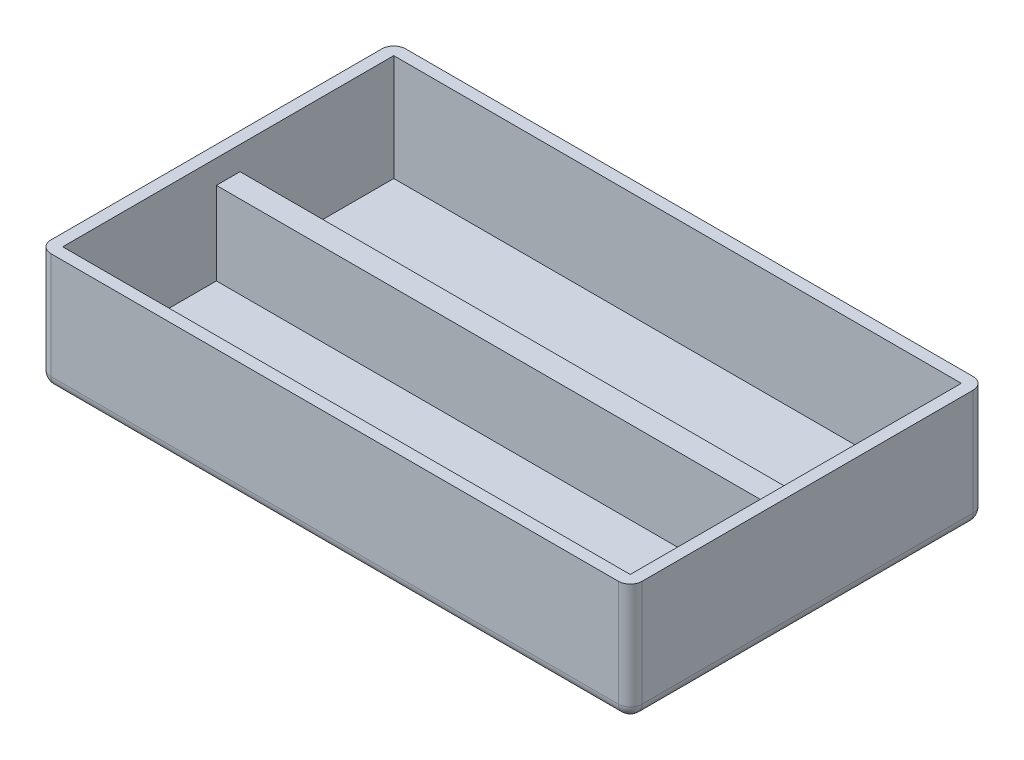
ISO-10303-21;
HEADER;
FILE_DESCRIPTION(('STEP AP214'),'2;1');
FILE_NAME('part.step','',(''),(''),'','','');
FILE_SCHEMA(('AUTOMOTIVE_DESIGN { 1 0 10303 214 1 1 1 1 }'));
ENDSEC;
DATA;
#1=APPLICATION_CONTEXT('core data for automotive mechanical design processes');
#2=APPLICATION_PROTOCOL_DEFINITION('international standard','automotive_design',2000,#1);
#3=PRODUCT_CONTEXT('',#1,'mechanical');
#4=PRODUCT('Part','Part','',(#3));
#5=PRODUCT_RELATED_PRODUCT_CATEGORY('part','',(#4));
#6=PRODUCT_DEFINITION_FORMATION('','',#4);
#7=PRODUCT_DEFINITION_CONTEXT('part definition',#1,'design');
#8=PRODUCT_DEFINITION('design','',#6,#7);
#9=PRODUCT_DEFINITION_SHAPE('','',#8);
#10=(LENGTH_UNIT() NAMED_UNIT(*) SI_UNIT(.MILLI.,.METRE.));
#11=(NAMED_UNIT(*) PLANE_ANGLE_UNIT() SI_UNIT($,.RADIAN.));
#12=(NAMED_UNIT(*) SI_UNIT($,.STERADIAN.) SOLID_ANGLE_UNIT());
#13=UNCERTAINTY_MEASURE_WITH_UNIT(LENGTH_MEASURE(1.E-05),#10,'distance_accuracy_value','');
#14=(GEOMETRIC_REPRESENTATION_CONTEXT(3) GLOBAL_UNCERTAINTY_ASSIGNED_CONTEXT((#13)) GLOBAL_UNIT_ASSIGNED_CONTEXT((#10,
#11,#12)) REPRESENTATION_CONTEXT('',''));
#15=CARTESIAN_POINT('',(0.,0.,0.));
#16=DIRECTION('',(0.,0.,1.));
#17=DIRECTION('',(1.,0.,0.));
#18=AXIS2_PLACEMENT_3D('',#15,#16,#17);
#19=CARTESIAN_POINT('',(60.96,25.4,-38.1));
#20=DIRECTION('',(-1.,0.,0.));
#21=DIRECTION('',(0.,0.,1.));
#22=AXIS2_PLACEMENT_3D('',#19,#20,#21);
#23=PLANE('',#22);
#24=DIRECTION('',(0.,0.,-1.));
#25=VECTOR('',#24,1.);
#26=CARTESIAN_POINT('',(60.96,20.32,-38.1));
#27=LINE('',#26,#25);
#28=CARTESIAN_POINT('',(60.96,20.32,2.54));
#29=VERTEX_POINT('',#28);
#30=CARTESIAN_POINT('',(60.96,20.32,-2.54));
#31=VERTEX_POINT('',#30);
#32=EDGE_CURVE('E11',#29,#31,#27,.T.);
#33=ORIENTED_EDGE('',*,*,#32,.F.);
#34=DIRECTION('',(0.,-1.,0.));
#35=VECTOR('',#34,1.);
#36=CARTESIAN_POINT('',(60.96,25.4,2.54));
#37=LINE('',#36,#35);
#38=CARTESIAN_POINT('',(60.96,2.54,2.54));
#39=VERTEX_POINT('',#38);
#40=EDGE_CURVE('E301',#29,#39,#37,.T.);
#41=ORIENTED_EDGE('',*,*,#40,.T.);
#42=DIRECTION('',(0.,0.,-1.));
#43=VECTOR('',#42,1.);
#44=CARTESIAN_POINT('',(60.96,2.54,-38.1));
#45=LINE('',#44,#43);
#46=CARTESIAN_POINT('',(60.96,2.54,35.56));
#47=VERTEX_POINT('',#46);
#48=EDGE_CURVE('E190',#47,#39,#45,.T.);
#49=ORIENTED_EDGE('',*,*,#48,.F.);
#50=DIRECTION('',(0.,1.,0.));
#51=VECTOR('',#50,1.);
#52=CARTESIAN_POINT('',(60.96,25.4,35.56));
#53=LINE('',#52,#51);
#54=CARTESIAN_POINT('',(60.96,25.4,35.56));
#55=VERTEX_POINT('',#54);
#56=EDGE_CURVE('E173',#47,#55,#53,.T.);
#57=ORIENTED_EDGE('',*,*,#56,.T.);
#58=DIRECTION('',(0.,0.,-1.));
#59=VECTOR('',#58,1.);
#60=CARTESIAN_POINT('',(60.96,25.4,-38.1));
#61=LINE('',#60,#59);
#62=CARTESIAN_POINT('',(60.96,25.4,-35.56));
#63=VERTEX_POINT('',#62);
#64=EDGE_CURVE('E198',#55,#63,#61,.T.);
#65=ORIENTED_EDGE('',*,*,#64,.T.);
#66=DIRECTION('',(0.,1.,0.));
#67=VECTOR('',#66,1.);
#68=CARTESIAN_POINT('',(60.96,25.4,-35.56));
#69=LINE('',#68,#67);
#70=CARTESIAN_POINT('',(60.96,2.54,-35.56));
#71=VERTEX_POINT('',#70);
#72=EDGE_CURVE('E188',#71,#63,#69,.T.);
#73=ORIENTED_EDGE('',*,*,#72,.F.);
#74=CARTESIAN_POINT('',(60.96,2.54,-2.54));
#75=VERTEX_POINT('',#74);
#76=EDGE_CURVE('E187',#75,#71,#45,.T.);
#77=ORIENTED_EDGE('',*,*,#76,.F.);
#78=DIRECTION('',(0.,-1.,0.));
#79=VECTOR('',#78,1.);
#80=CARTESIAN_POINT('',(60.96,25.4,-2.54));
#81=LINE('',#80,#79);
#82=EDGE_CURVE('E294',#31,#75,#81,.T.);
#83=ORIENTED_EDGE('',*,*,#82,.F.);
#84=EDGE_LOOP('',(#33,#41,#49,#57,#65,#73,#77,#83));
#85=FACE_BOUND('',#84,.T.);
#86=ADVANCED_FACE('F35',(#85),#23,.T.);
#87=CARTESIAN_POINT('',(-63.5,2.54,38.1));
#88=DIRECTION('',(0.,1.,0.));
#89=DIRECTION('',(0.,0.,1.));
#90=AXIS2_PLACEMENT_3D('',#87,#88,#89);
#91=PLANE('',#90);
#92=ORIENTED_EDGE('',*,*,#48,.T.);
#93=DIRECTION('',(1.,0.,0.));
#94=VECTOR('',#93,1.);
#95=CARTESIAN_POINT('',(-63.5,2.54,2.54));
#96=LINE('',#95,#94);
#97=CARTESIAN_POINT('',(-60.96,2.54,2.54));
#98=VERTEX_POINT('',#97);
#99=EDGE_CURVE('E44',#98,#39,#96,.T.);
#100=ORIENTED_EDGE('',*,*,#99,.F.);
#101=DIRECTION('',(0.,0.,-1.));
#102=VECTOR('',#101,1.);
#103=CARTESIAN_POINT('',(-60.96,2.54,38.1));
#104=LINE('',#103,#102);
#105=CARTESIAN_POINT('',(-60.96,2.54,35.56));
#106=VERTEX_POINT('',#105);
#107=EDGE_CURVE('E172',#106,#98,#104,.T.);
#108=ORIENTED_EDGE('',*,*,#107,.F.);
#109=DIRECTION('',(-1.,0.,0.));
#110=VECTOR('',#109,1.);
#111=CARTESIAN_POINT('',(-63.5,2.54,35.56));
#112=LINE('',#111,#110);
#113=EDGE_CURVE('E295',#47,#106,#112,.T.);
#114=ORIENTED_EDGE('',*,*,#113,.F.);
#115=EDGE_LOOP('',(#92,#100,#108,#114));
#116=FACE_BOUND('',#115,.T.);
#117=ADVANCED_FACE('F316',(#116),#91,.T.);
#118=CARTESIAN_POINT('',(-63.5,25.4,-38.1));
#119=DIRECTION('',(1.,0.,0.));
#120=DIRECTION('',(0.,0.,-1.));
#121=AXIS2_PLACEMENT_3D('',#118,#119,#120);
#122=PLANE('',#121);
#123=DIRECTION('',(0.,0.,1.));
#124=VECTOR('',#123,1.);
#125=CARTESIAN_POINT('',(-63.5,2.54,-38.1));
#126=LINE('',#125,#124);
#127=CARTESIAN_POINT('',(-63.5,2.54,-35.56));
#128=VERTEX_POINT('',#127);
#129=CARTESIAN_POINT('',(-63.5,2.54,35.56));
#130=VERTEX_POINT('',#129);
#131=EDGE_CURVE('E245',#128,#130,#126,.T.);
#132=ORIENTED_EDGE('',*,*,#131,.T.);
#133=DIRECTION('',(0.,-1.,0.));
#134=VECTOR('',#133,1.);
#135=CARTESIAN_POINT('',(-63.5,25.4,35.56));
#136=LINE('',#135,#134);
#137=CARTESIAN_POINT('',(-63.5,25.4,35.56));
#138=VERTEX_POINT('',#137);
#139=EDGE_CURVE('E243',#130,#138,#136,.F.);
#140=ORIENTED_EDGE('',*,*,#139,.T.);
#141=DIRECTION('',(0.,0.,1.));
#142=VECTOR('',#141,1.);
#143=CARTESIAN_POINT('',(-63.5,25.4,-38.1));
#144=LINE('',#143,#142);
#145=CARTESIAN_POINT('',(-63.5,25.4,-35.56));
#146=VERTEX_POINT('',#145);
#147=EDGE_CURVE('E202',#146,#138,#144,.T.);
#148=ORIENTED_EDGE('',*,*,#147,.F.);
#149=DIRECTION('',(0.,-1.,0.));
#150=VECTOR('',#149,1.);
#151=CARTESIAN_POINT('',(-63.5,25.4,-35.56));
#152=LINE('',#151,#150);
#153=EDGE_CURVE('E247',#146,#128,#152,.T.);
#154=ORIENTED_EDGE('',*,*,#153,.T.);
#155=EDGE_LOOP('',(#132,#140,#148,#154));
#156=FACE_BOUND('',#155,.T.);
#157=ADVANCED_FACE('F339',(#156),#122,.F.);
#158=CARTESIAN_POINT('',(-63.5,25.4,38.1));
#159=DIRECTION('',(0.,0.,-1.));
#160=DIRECTION('',(-1.,0.,0.));
#161=AXIS2_PLACEMENT_3D('',#158,#159,#160);
#162=PLANE('',#161);
#163=DIRECTION('',(1.,0.,0.));
#164=VECTOR('',#163,1.);
#165=CARTESIAN_POINT('',(-63.5,2.54,38.1));
#166=LINE('',#165,#164);
#167=CARTESIAN_POINT('',(-60.96,2.54,38.1));
#168=VERTEX_POINT('',#167);
#169=CARTESIAN_POINT('',(60.96,2.54,38.1));
#170=VERTEX_POINT('',#169);
#171=EDGE_CURVE('E217',#168,#170,#166,.T.);
#172=ORIENTED_EDGE('',*,*,#171,.T.);
#173=DIRECTION('',(0.,-1.,0.));
#174=VECTOR('',#173,1.);
#175=CARTESIAN_POINT('',(60.96,25.4,38.1));
#176=LINE('',#175,#174);
#177=CARTESIAN_POINT('',(60.96,25.4,38.1));
#178=VERTEX_POINT('',#177);
#179=EDGE_CURVE('E220',#170,#178,#176,.F.);
#180=ORIENTED_EDGE('',*,*,#179,.T.);
#181=DIRECTION('',(1.,0.,0.));
#182=VECTOR('',#181,1.);
#183=CARTESIAN_POINT('',(-63.5,25.4,38.1));
#184=LINE('',#183,#182);
#185=CARTESIAN_POINT('',(-60.96,25.4,38.1));
#186=VERTEX_POINT('',#185);
#187=EDGE_CURVE('E205',#186,#178,#184,.T.);
#188=ORIENTED_EDGE('',*,*,#187,.F.);
#189=DIRECTION('',(0.,-1.,0.));
#190=VECTOR('',#189,1.);
#191=CARTESIAN_POINT('',(-60.96,25.4,38.1));
#192=LINE('',#191,#190);
#193=EDGE_CURVE('E215',#186,#168,#192,.T.);
#194=ORIENTED_EDGE('',*,*,#193,.T.);
#195=EDGE_LOOP('',(#172,#180,#188,#194));
#196=FACE_BOUND('',#195,.T.);
#197=ADVANCED_FACE('F360',(#196),#162,.F.);
#198=CARTESIAN_POINT('',(63.5,25.4,-38.1));
#199=DIRECTION('',(-1.,0.,0.));
#200=DIRECTION('',(0.,0.,1.));
#201=AXIS2_PLACEMENT_3D('',#198,#199,#200);
#202=PLANE('',#201);
#203=DIRECTION('',(0.,0.,-1.));
#204=VECTOR('',#203,1.);
#205=CARTESIAN_POINT('',(63.5,2.54,-38.1));
#206=LINE('',#205,#204);
#207=CARTESIAN_POINT('',(63.5,2.54,35.56));
#208=VERTEX_POINT('',#207);
#209=CARTESIAN_POINT('',(63.5,2.54,-35.56));
#210=VERTEX_POINT('',#209);
#211=EDGE_CURVE('E233',#208,#210,#206,.T.);
#212=ORIENTED_EDGE('',*,*,#211,.T.);
#213=DIRECTION('',(0.,-1.,0.));
#214=VECTOR('',#213,1.);
#215=CARTESIAN_POINT('',(63.5,25.4,-35.56));
#216=LINE('',#215,#214);
#217=CARTESIAN_POINT('',(63.5,25.4,-35.56));
#218=VERTEX_POINT('',#217);
#219=EDGE_CURVE('E235',#210,#218,#216,.F.);
#220=ORIENTED_EDGE('',*,*,#219,.T.);
#221=DIRECTION('',(0.,0.,-1.));
#222=VECTOR('',#221,1.);
#223=CARTESIAN_POINT('',(63.5,25.4,-38.1));
#224=LINE('',#223,#222);
#225=CARTESIAN_POINT('',(63.5,25.4,35.56));
#226=VERTEX_POINT('',#225);
#227=EDGE_CURVE('E209',#226,#218,#224,.T.);
#228=ORIENTED_EDGE('',*,*,#227,.F.);
#229=DIRECTION('',(0.,-1.,0.));
#230=VECTOR('',#229,1.);
#231=CARTESIAN_POINT('',(63.5,25.4,35.56));
#232=LINE('',#231,#230);
#233=EDGE_CURVE('E231',#226,#208,#232,.T.);
#234=ORIENTED_EDGE('',*,*,#233,.T.);
#235=EDGE_LOOP('',(#212,#220,#228,#234));
#236=FACE_BOUND('',#235,.T.);
#237=ADVANCED_FACE('F356',(#236),#202,.F.);
#238=CARTESIAN_POINT('',(-63.5,25.4,-38.1));
#239=DIRECTION('',(0.,0.,1.));
#240=DIRECTION('',(1.,0.,0.));
#241=AXIS2_PLACEMENT_3D('',#238,#239,#240);
#242=PLANE('',#241);
#243=DIRECTION('',(-1.,0.,0.));
#244=VECTOR('',#243,1.);
#245=CARTESIAN_POINT('',(-63.5,2.54,-38.1));
#246=LINE('',#245,#244);
#247=CARTESIAN_POINT('',(60.96,2.54,-38.1));
#248=VERTEX_POINT('',#247);
#249=CARTESIAN_POINT('',(-60.96,2.54,-38.1));
#250=VERTEX_POINT('',#249);
#251=EDGE_CURVE('E239',#248,#250,#246,.T.);
#252=ORIENTED_EDGE('',*,*,#251,.T.);
#253=DIRECTION('',(0.,-1.,0.));
#254=VECTOR('',#253,1.);
#255=CARTESIAN_POINT('',(-60.96,25.4,-38.1));
#256=LINE('',#255,#254);
#257=CARTESIAN_POINT('',(-60.96,25.4,-38.1));
#258=VERTEX_POINT('',#257);
#259=EDGE_CURVE('E241',#250,#258,#256,.F.);
#260=ORIENTED_EDGE('',*,*,#259,.T.);
#261=DIRECTION('',(-1.,0.,0.));
#262=VECTOR('',#261,1.);
#263=CARTESIAN_POINT('',(-63.5,25.4,-38.1));
#264=LINE('',#263,#262);
#265=CARTESIAN_POINT('',(60.96,25.4,-38.1));
#266=VERTEX_POINT('',#265);
#267=EDGE_CURVE('E212',#266,#258,#264,.T.);
#268=ORIENTED_EDGE('',*,*,#267,.F.);
#269=DIRECTION('',(0.,-1.,0.));
#270=VECTOR('',#269,1.);
#271=CARTESIAN_POINT('',(60.96,25.4,-38.1));
#272=LINE('',#271,#270);
#273=EDGE_CURVE('E237',#266,#248,#272,.T.);
#274=ORIENTED_EDGE('',*,*,#273,.T.);
#275=EDGE_LOOP('',(#252,#260,#268,#274));
#276=FACE_BOUND('',#275,.T.);
#277=ADVANCED_FACE('F349',(#276),#242,.F.);
#278=CARTESIAN_POINT('',(-63.5,25.4,38.1));
#279=DIRECTION('',(0.,1.,0.));
#280=DIRECTION('',(0.,0.,1.));
#281=AXIS2_PLACEMENT_3D('',#278,#279,#280);
#282=PLANE('',#281);
#283=DIRECTION('',(-1.,0.,0.));
#284=VECTOR('',#283,1.);
#285=CARTESIAN_POINT('',(-63.5,25.4,-35.56));
#286=LINE('',#285,#284);
#287=CARTESIAN_POINT('',(-60.96,25.4,-35.56));
#288=VERTEX_POINT('',#287);
#289=EDGE_CURVE('E181',#63,#288,#286,.T.);
#290=ORIENTED_EDGE('',*,*,#289,.F.);
#291=ORIENTED_EDGE('',*,*,#64,.F.);
#292=DIRECTION('',(1.,0.,0.));
#293=VECTOR('',#292,1.);
#294=CARTESIAN_POINT('',(-63.5,25.4,35.56));
#295=LINE('',#294,#293);
#296=CARTESIAN_POINT('',(-60.96,25.4,35.56));
#297=VERTEX_POINT('',#296);
#298=EDGE_CURVE('E196',#297,#55,#295,.T.);
#299=ORIENTED_EDGE('',*,*,#298,.F.);
#300=DIRECTION('',(0.,0.,1.));
#301=VECTOR('',#300,1.);
#302=CARTESIAN_POINT('',(-60.96,25.4,-38.1));
#303=LINE('',#302,#301);
#304=EDGE_CURVE('E194',#288,#297,#303,.T.);
#305=ORIENTED_EDGE('',*,*,#304,.F.);
#306=EDGE_LOOP('',(#290,#291,#299,#305));
#307=FACE_BOUND('',#306,.T.);
#308=ORIENTED_EDGE('',*,*,#267,.T.);
#309=CARTESIAN_POINT('',(-60.96,25.4,-35.56));
#310=DIRECTION('',(0.,1.,0.));
#311=DIRECTION('',(0.,0.,1.));
#312=AXIS2_PLACEMENT_3D('',#309,#310,#311);
#313=CIRCLE('',#312,2.54);
#314=EDGE_CURVE('E255',#258,#146,#313,.T.);
#315=ORIENTED_EDGE('',*,*,#314,.T.);
#316=ORIENTED_EDGE('',*,*,#147,.T.);
#317=CARTESIAN_POINT('',(-60.96,25.4,35.56));
#318=DIRECTION('',(0.,1.,0.));
#319=DIRECTION('',(0.,0.,1.));
#320=AXIS2_PLACEMENT_3D('',#317,#318,#319);
#321=CIRCLE('',#320,2.54);
#322=EDGE_CURVE('E249',#138,#186,#321,.T.);
#323=ORIENTED_EDGE('',*,*,#322,.T.);
#324=ORIENTED_EDGE('',*,*,#187,.T.);
#325=CARTESIAN_POINT('',(60.96,25.4,35.56));
#326=DIRECTION('',(0.,1.,0.));
#327=DIRECTION('',(0.,0.,1.));
#328=AXIS2_PLACEMENT_3D('',#325,#326,#327);
#329=CIRCLE('',#328,2.54);
#330=EDGE_CURVE('E251',#178,#226,#329,.T.);
#331=ORIENTED_EDGE('',*,*,#330,.T.);
#332=ORIENTED_EDGE('',*,*,#227,.T.);
#333=CARTESIAN_POINT('',(60.96,25.4,-35.56));
#334=DIRECTION('',(0.,1.,0.));
#335=DIRECTION('',(0.,0.,1.));
#336=AXIS2_PLACEMENT_3D('',#333,#334,#335);
#337=CIRCLE('',#336,2.54);
#338=EDGE_CURVE('E253',#218,#266,#337,.T.);
#339=ORIENTED_EDGE('',*,*,#338,.T.);
#340=EDGE_LOOP('',(#308,#315,#316,#323,#324,#331,#332,#339));
#341=FACE_BOUND('',#340,.T.);
#342=ADVANCED_FACE('F345',(#307,#341),#282,.T.);
#343=CARTESIAN_POINT('',(-63.5,0.,38.1));
#344=DIRECTION('',(0.,1.,0.));
#345=DIRECTION('',(0.,0.,1.));
#346=AXIS2_PLACEMENT_3D('',#343,#344,#345);
#347=PLANE('',#346);
#348=DIRECTION('',(0.,0.,-1.));
#349=VECTOR('',#348,1.);
#350=CARTESIAN_POINT('',(60.96,0.,38.1));
#351=LINE('',#350,#349);
#352=CARTESIAN_POINT('',(60.96,0.,-35.56));
#353=VERTEX_POINT('',#352);
#354=CARTESIAN_POINT('',(60.96,0.,35.56));
#355=VERTEX_POINT('',#354);
#356=EDGE_CURVE('E226',#353,#355,#351,.F.);
#357=ORIENTED_EDGE('',*,*,#356,.T.);
#358=DIRECTION('',(1.,0.,0.));
#359=VECTOR('',#358,1.);
#360=CARTESIAN_POINT('',(-63.5,0.,35.56));
#361=LINE('',#360,#359);
#362=CARTESIAN_POINT('',(-60.96,0.,35.56));
#363=VERTEX_POINT('',#362);
#364=EDGE_CURVE('E228',#355,#363,#361,.F.);
#365=ORIENTED_EDGE('',*,*,#364,.T.);
#366=DIRECTION('',(0.,0.,1.));
#367=VECTOR('',#366,1.);
#368=CARTESIAN_POINT('',(-60.96,0.,38.1));
#369=LINE('',#368,#367);
#370=CARTESIAN_POINT('',(-60.96,0.,-35.56));
#371=VERTEX_POINT('',#370);
#372=EDGE_CURVE('E222',#363,#371,#369,.F.);
#373=ORIENTED_EDGE('',*,*,#372,.T.);
#374=DIRECTION('',(-1.,0.,0.));
#375=VECTOR('',#374,1.);
#376=CARTESIAN_POINT('',(-63.5,0.,-35.56));
#377=LINE('',#376,#375);
#378=EDGE_CURVE('E224',#371,#353,#377,.F.);
#379=ORIENTED_EDGE('',*,*,#378,.T.);
#380=EDGE_LOOP('',(#357,#365,#373,#379));
#381=FACE_BOUND('',#380,.T.);
#382=ADVANCED_FACE('F348',(#381),#347,.F.);
#383=CARTESIAN_POINT('',(-60.96,25.4,-35.56));
#384=DIRECTION('',(0.,-1.,0.));
#385=DIRECTION('',(0.,0.,-1.));
#386=AXIS2_PLACEMENT_3D('',#383,#384,#385);
#387=CYLINDRICAL_SURFACE('',#386,2.54);
#388=ORIENTED_EDGE('',*,*,#314,.F.);
#389=ORIENTED_EDGE('',*,*,#259,.F.);
#390=CARTESIAN_POINT('',(-60.96,2.54,-35.56));
#391=DIRECTION('',(0.,-1.,0.));
#392=DIRECTION('',(0.,0.,-1.));
#393=AXIS2_PLACEMENT_3D('',#390,#391,#392);
#394=CIRCLE('',#393,2.54);
#395=EDGE_CURVE('E285',#128,#250,#394,.T.);
#396=ORIENTED_EDGE('',*,*,#395,.F.);
#397=ORIENTED_EDGE('',*,*,#153,.F.);
#398=EDGE_LOOP('',(#388,#389,#396,#397));
#399=FACE_BOUND('',#398,.T.);
#400=ADVANCED_FACE('F37',(#399),#387,.T.);
#401=CARTESIAN_POINT('',(60.96,25.4,-35.56));
#402=DIRECTION('',(0.,-1.,0.));
#403=DIRECTION('',(0.,0.,-1.));
#404=AXIS2_PLACEMENT_3D('',#401,#402,#403);
#405=CYLINDRICAL_SURFACE('',#404,2.54);
#406=ORIENTED_EDGE('',*,*,#338,.F.);
#407=ORIENTED_EDGE('',*,*,#219,.F.);
#408=CARTESIAN_POINT('',(60.96,2.54,-35.56));
#409=DIRECTION('',(0.,-1.,0.));
#410=DIRECTION('',(0.,0.,-1.));
#411=AXIS2_PLACEMENT_3D('',#408,#409,#410);
#412=CIRCLE('',#411,2.54);
#413=EDGE_CURVE('E282',#248,#210,#412,.T.);
#414=ORIENTED_EDGE('',*,*,#413,.F.);
#415=ORIENTED_EDGE('',*,*,#273,.F.);
#416=EDGE_LOOP('',(#406,#407,#414,#415));
#417=FACE_BOUND('',#416,.T.);
#418=ADVANCED_FACE('F406',(#417),#405,.T.);
#419=CARTESIAN_POINT('',(-63.5,2.54,-35.56));
#420=DIRECTION('',(-1.,0.,0.));
#421=DIRECTION('',(0.,0.,1.));
#422=AXIS2_PLACEMENT_3D('',#419,#420,#421);
#423=CYLINDRICAL_SURFACE('',#422,2.54);
#424=CARTESIAN_POINT('',(-60.96,2.54,-35.56));
#425=DIRECTION('',(-1.,0.,0.));
#426=DIRECTION('',(0.,0.,1.));
#427=AXIS2_PLACEMENT_3D('',#424,#425,#426);
#428=CIRCLE('',#427,2.54);
#429=EDGE_CURVE('E206',#250,#371,#428,.T.);
#430=ORIENTED_EDGE('',*,*,#429,.F.);
#431=ORIENTED_EDGE('',*,*,#251,.F.);
#432=CARTESIAN_POINT('',(60.96,2.54,-35.56));
#433=DIRECTION('',(1.,0.,0.));
#434=DIRECTION('',(0.,0.,-1.));
#435=AXIS2_PLACEMENT_3D('',#432,#433,#434);
#436=CIRCLE('',#435,2.54);
#437=EDGE_CURVE('E279',#353,#248,#436,.T.);
#438=ORIENTED_EDGE('',*,*,#437,.F.);
#439=ORIENTED_EDGE('',*,*,#378,.F.);
#440=EDGE_LOOP('',(#430,#431,#438,#439));
#441=FACE_BOUND('',#440,.T.);
#442=ADVANCED_FACE('F403',(#441),#423,.T.);
#443=CARTESIAN_POINT('',(-60.96,2.54,-35.56));
#444=DIRECTION('',(0.,0.,1.));
#445=DIRECTION('',(1.,0.,0.));
#446=AXIS2_PLACEMENT_3D('',#443,#444,#445);
#447=SPHERICAL_SURFACE('',#446,2.54);
#448=ORIENTED_EDGE('',*,*,#395,.T.);
#449=ORIENTED_EDGE('',*,*,#429,.T.);
#450=CARTESIAN_POINT('',(-60.96,2.54,-35.56));
#451=DIRECTION('',(0.,0.,-1.));
#452=DIRECTION('',(-1.,0.,0.));
#453=AXIS2_PLACEMENT_3D('',#450,#451,#452);
#454=CIRCLE('',#453,2.54);
#455=EDGE_CURVE('E276',#128,#371,#454,.F.);
#456=ORIENTED_EDGE('',*,*,#455,.F.);
#457=EDGE_LOOP('',(#448,#449,#456));
#458=FACE_BOUND('',#457,.T.);
#459=ADVANCED_FACE('F399',(#458),#447,.T.);
#460=CARTESIAN_POINT('',(60.96,2.54,-35.56));
#461=DIRECTION('',(0.,0.,1.));
#462=DIRECTION('',(1.,0.,0.));
#463=AXIS2_PLACEMENT_3D('',#460,#461,#462);
#464=SPHERICAL_SURFACE('',#463,2.54);
#465=ORIENTED_EDGE('',*,*,#437,.T.);
#466=ORIENTED_EDGE('',*,*,#413,.T.);
#467=CARTESIAN_POINT('',(60.96,2.54,-35.56));
#468=DIRECTION('',(0.,0.,-1.));
#469=DIRECTION('',(-1.,0.,0.));
#470=AXIS2_PLACEMENT_3D('',#467,#468,#469);
#471=CIRCLE('',#470,2.54);
#472=EDGE_CURVE('E273',#353,#210,#471,.F.);
#473=ORIENTED_EDGE('',*,*,#472,.F.);
#474=EDGE_LOOP('',(#465,#466,#473));
#475=FACE_BOUND('',#474,.T.);
#476=ADVANCED_FACE('F395',(#475),#464,.T.);
#477=CARTESIAN_POINT('',(-60.96,2.54,-38.1));
#478=DIRECTION('',(0.,0.,1.));
#479=DIRECTION('',(1.,0.,0.));
#480=AXIS2_PLACEMENT_3D('',#477,#478,#479);
#481=CYLINDRICAL_SURFACE('',#480,2.54);
#482=CARTESIAN_POINT('',(-60.96,2.54,35.56));
#483=DIRECTION('',(0.,0.,1.));
#484=DIRECTION('',(1.,0.,0.));
#485=AXIS2_PLACEMENT_3D('',#482,#483,#484);
#486=CIRCLE('',#485,2.54);
#487=EDGE_CURVE('E270',#130,#363,#486,.T.);
#488=ORIENTED_EDGE('',*,*,#487,.F.);
#489=ORIENTED_EDGE('',*,*,#131,.F.);
#490=ORIENTED_EDGE('',*,*,#455,.T.);
#491=ORIENTED_EDGE('',*,*,#372,.F.);
#492=EDGE_LOOP('',(#488,#489,#490,#491));
#493=FACE_BOUND('',#492,.T.);
#494=ADVANCED_FACE('F391',(#493),#481,.T.);
#495=CARTESIAN_POINT('',(-60.96,25.4,35.56));
#496=DIRECTION('',(0.,-1.,0.));
#497=DIRECTION('',(0.,0.,-1.));
#498=AXIS2_PLACEMENT_3D('',#495,#496,#497);
#499=CYLINDRICAL_SURFACE('',#498,2.54);
#500=ORIENTED_EDGE('',*,*,#322,.F.);
#501=ORIENTED_EDGE('',*,*,#139,.F.);
#502=CARTESIAN_POINT('',(-60.96,2.54,35.56));
#503=DIRECTION('',(0.,-1.,0.));
#504=DIRECTION('',(0.,0.,-1.));
#505=AXIS2_PLACEMENT_3D('',#502,#503,#504);
#506=CIRCLE('',#505,2.54);
#507=EDGE_CURVE('E267',#168,#130,#506,.T.);
#508=ORIENTED_EDGE('',*,*,#507,.F.);
#509=ORIENTED_EDGE('',*,*,#193,.F.);
#510=EDGE_LOOP('',(#500,#501,#508,#509));
#511=FACE_BOUND('',#510,.T.);
#512=ADVANCED_FACE('F387',(#511),#499,.T.);
#513=CARTESIAN_POINT('',(60.96,25.4,35.56));
#514=DIRECTION('',(0.,-1.,0.));
#515=DIRECTION('',(0.,0.,-1.));
#516=AXIS2_PLACEMENT_3D('',#513,#514,#515);
#517=CYLINDRICAL_SURFACE('',#516,2.54);
#518=ORIENTED_EDGE('',*,*,#330,.F.);
#519=ORIENTED_EDGE('',*,*,#179,.F.);
#520=CARTESIAN_POINT('',(60.96,2.54,35.56));
#521=DIRECTION('',(0.,-1.,0.));
#522=DIRECTION('',(0.,0.,-1.));
#523=AXIS2_PLACEMENT_3D('',#520,#521,#522);
#524=CIRCLE('',#523,2.54);
#525=EDGE_CURVE('E264',#208,#170,#524,.T.);
#526=ORIENTED_EDGE('',*,*,#525,.F.);
#527=ORIENTED_EDGE('',*,*,#233,.F.);
#528=EDGE_LOOP('',(#518,#519,#526,#527));
#529=FACE_BOUND('',#528,.T.);
#530=ADVANCED_FACE('F383',(#529),#517,.T.);
#531=CARTESIAN_POINT('',(60.96,2.54,-38.1));
#532=DIRECTION('',(0.,0.,-1.));
#533=DIRECTION('',(-1.,0.,0.));
#534=AXIS2_PLACEMENT_3D('',#531,#532,#533);
#535=CYLINDRICAL_SURFACE('',#534,2.54);
#536=ORIENTED_EDGE('',*,*,#472,.T.);
#537=ORIENTED_EDGE('',*,*,#211,.F.);
#538=CARTESIAN_POINT('',(60.96,2.54,35.56));
#539=DIRECTION('',(0.,0.,1.));
#540=DIRECTION('',(1.,0.,0.));
#541=AXIS2_PLACEMENT_3D('',#538,#539,#540);
#542=CIRCLE('',#541,2.54);
#543=EDGE_CURVE('E261',#355,#208,#542,.T.);
#544=ORIENTED_EDGE('',*,*,#543,.F.);
#545=ORIENTED_EDGE('',*,*,#356,.F.);
#546=EDGE_LOOP('',(#536,#537,#544,#545));
#547=FACE_BOUND('',#546,.T.);
#548=ADVANCED_FACE('F379',(#547),#535,.T.);
#549=CARTESIAN_POINT('',(-60.96,2.54,35.56));
#550=DIRECTION('',(0.,0.,1.));
#551=DIRECTION('',(1.,0.,0.));
#552=AXIS2_PLACEMENT_3D('',#549,#550,#551);
#553=SPHERICAL_SURFACE('',#552,2.54);
#554=ORIENTED_EDGE('',*,*,#507,.T.);
#555=ORIENTED_EDGE('',*,*,#487,.T.);
#556=CARTESIAN_POINT('',(-60.96,2.54,35.56));
#557=DIRECTION('',(-1.,0.,0.));
#558=DIRECTION('',(0.,0.,1.));
#559=AXIS2_PLACEMENT_3D('',#556,#557,#558);
#560=CIRCLE('',#559,2.54);
#561=EDGE_CURVE('E259',#168,#363,#560,.F.);
#562=ORIENTED_EDGE('',*,*,#561,.F.);
#563=EDGE_LOOP('',(#554,#555,#562));
#564=FACE_BOUND('',#563,.T.);
#565=ADVANCED_FACE('F375',(#564),#553,.T.);
#566=CARTESIAN_POINT('',(60.96,2.54,35.56));
#567=DIRECTION('',(0.,0.,1.));
#568=DIRECTION('',(1.,0.,0.));
#569=AXIS2_PLACEMENT_3D('',#566,#567,#568);
#570=SPHERICAL_SURFACE('',#569,2.54);
#571=ORIENTED_EDGE('',*,*,#543,.T.);
#572=ORIENTED_EDGE('',*,*,#525,.T.);
#573=CARTESIAN_POINT('',(60.96,2.54,35.56));
#574=DIRECTION('',(1.,0.,0.));
#575=DIRECTION('',(0.,0.,-1.));
#576=AXIS2_PLACEMENT_3D('',#573,#574,#575);
#577=CIRCLE('',#576,2.54);
#578=EDGE_CURVE('E257',#355,#170,#577,.F.);
#579=ORIENTED_EDGE('',*,*,#578,.F.);
#580=EDGE_LOOP('',(#571,#572,#579));
#581=FACE_BOUND('',#580,.T.);
#582=ADVANCED_FACE('F371',(#581),#570,.T.);
#583=CARTESIAN_POINT('',(-63.5,2.54,35.56));
#584=DIRECTION('',(1.,0.,0.));
#585=DIRECTION('',(0.,0.,-1.));
#586=AXIS2_PLACEMENT_3D('',#583,#584,#585);
#587=CYLINDRICAL_SURFACE('',#586,2.54);
#588=ORIENTED_EDGE('',*,*,#561,.T.);
#589=ORIENTED_EDGE('',*,*,#364,.F.);
#590=ORIENTED_EDGE('',*,*,#578,.T.);
#591=ORIENTED_EDGE('',*,*,#171,.F.);
#592=EDGE_LOOP('',(#588,#589,#590,#591));
#593=FACE_BOUND('',#592,.T.);
#594=ADVANCED_FACE('F368',(#593),#587,.T.);
#595=CARTESIAN_POINT('',(-60.96,25.4,-38.1));
#596=DIRECTION('',(1.,0.,0.));
#597=DIRECTION('',(0.,0.,-1.));
#598=AXIS2_PLACEMENT_3D('',#595,#596,#597);
#599=PLANE('',#598);
#600=DIRECTION('',(0.,-1.,0.));
#601=VECTOR('',#600,1.);
#602=CARTESIAN_POINT('',(-60.96,25.4,2.54));
#603=LINE('',#602,#601);
#604=CARTESIAN_POINT('',(-60.96,20.32,2.54));
#605=VERTEX_POINT('',#604);
#606=EDGE_CURVE('E299',#605,#98,#603,.T.);
#607=ORIENTED_EDGE('',*,*,#606,.F.);
#608=DIRECTION('',(0.,0.,1.));
#609=VECTOR('',#608,1.);
#610=CARTESIAN_POINT('',(-60.96,20.32,-38.1));
#611=LINE('',#610,#609);
#612=CARTESIAN_POINT('',(-60.96,20.32,-2.54));
#613=VERTEX_POINT('',#612);
#614=EDGE_CURVE('E59',#613,#605,#611,.T.);
#615=ORIENTED_EDGE('',*,*,#614,.F.);
#616=DIRECTION('',(0.,-1.,0.));
#617=VECTOR('',#616,1.);
#618=CARTESIAN_POINT('',(-60.96,25.4,-2.54));
#619=LINE('',#618,#617);
#620=CARTESIAN_POINT('',(-60.96,2.54,-2.54));
#621=VERTEX_POINT('',#620);
#622=EDGE_CURVE('E168',#613,#621,#619,.T.);
#623=ORIENTED_EDGE('',*,*,#622,.T.);
#624=CARTESIAN_POINT('',(-60.96,2.54,-35.56));
#625=VERTEX_POINT('',#624);
#626=EDGE_CURVE('E162',#621,#625,#104,.T.);
#627=ORIENTED_EDGE('',*,*,#626,.T.);
#628=DIRECTION('',(0.,1.,0.));
#629=VECTOR('',#628,1.);
#630=CARTESIAN_POINT('',(-60.96,25.4,-35.56));
#631=LINE('',#630,#629);
#632=EDGE_CURVE('E166',#625,#288,#631,.T.);
#633=ORIENTED_EDGE('',*,*,#632,.T.);
#634=ORIENTED_EDGE('',*,*,#304,.T.);
#635=DIRECTION('',(0.,1.,0.));
#636=VECTOR('',#635,1.);
#637=CARTESIAN_POINT('',(-60.96,25.4,35.56));
#638=LINE('',#637,#636);
#639=EDGE_CURVE('E183',#106,#297,#638,.T.);
#640=ORIENTED_EDGE('',*,*,#639,.F.);
#641=ORIENTED_EDGE('',*,*,#107,.T.);
#642=EDGE_LOOP('',(#607,#615,#623,#627,#633,#634,#640,#641));
#643=FACE_BOUND('',#642,.T.);
#644=ADVANCED_FACE('F164',(#643),#599,.T.);
#645=CARTESIAN_POINT('',(-63.5,25.4,35.56));
#646=DIRECTION('',(0.,0.,-1.));
#647=DIRECTION('',(-1.,0.,0.));
#648=AXIS2_PLACEMENT_3D('',#645,#646,#647);
#649=PLANE('',#648);
#650=ORIENTED_EDGE('',*,*,#113,.T.);
#651=ORIENTED_EDGE('',*,*,#639,.T.);
#652=ORIENTED_EDGE('',*,*,#298,.T.);
#653=ORIENTED_EDGE('',*,*,#56,.F.);
#654=EDGE_LOOP('',(#650,#651,#652,#653));
#655=FACE_BOUND('',#654,.T.);
#656=ADVANCED_FACE('F342',(#655),#649,.T.);
#657=CARTESIAN_POINT('',(-63.5,25.4,-35.56));
#658=DIRECTION('',(0.,0.,1.));
#659=DIRECTION('',(1.,0.,0.));
#660=AXIS2_PLACEMENT_3D('',#657,#658,#659);
#661=PLANE('',#660);
#662=DIRECTION('',(-1.,0.,0.));
#663=VECTOR('',#662,1.);
#664=CARTESIAN_POINT('',(-63.5,2.54,-35.56));
#665=LINE('',#664,#663);
#666=EDGE_CURVE('E178',#71,#625,#665,.T.);
#667=ORIENTED_EDGE('',*,*,#666,.F.);
#668=ORIENTED_EDGE('',*,*,#72,.T.);
#669=ORIENTED_EDGE('',*,*,#289,.T.);
#670=ORIENTED_EDGE('',*,*,#632,.F.);
#671=EDGE_LOOP('',(#667,#668,#669,#670));
#672=FACE_BOUND('',#671,.T.);
#673=ADVANCED_FACE('F177',(#672),#661,.T.);
#674=DIRECTION('',(1.,0.,0.));
#675=VECTOR('',#674,1.);
#676=CARTESIAN_POINT('',(-63.5,2.54,-2.54));
#677=LINE('',#676,#675);
#678=EDGE_CURVE('E39',#621,#75,#677,.T.);
#679=ORIENTED_EDGE('',*,*,#678,.T.);
#680=ORIENTED_EDGE('',*,*,#76,.T.);
#681=ORIENTED_EDGE('',*,*,#666,.T.);
#682=ORIENTED_EDGE('',*,*,#626,.F.);
#683=EDGE_LOOP('',(#679,#680,#681,#682));
#684=FACE_BOUND('',#683,.T.);
#685=ADVANCED_FACE('F185',(#684),#91,.T.);
#686=CARTESIAN_POINT('',(-47.6689350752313,20.32,0.));
#687=DIRECTION('',(0.,1.,0.));
#688=DIRECTION('',(-1.,0.,0.));
#689=AXIS2_PLACEMENT_3D('',#686,#687,#688);
#690=PLANE('',#689);
#691=DIRECTION('',(1.,0.,0.));
#692=VECTOR('',#691,1.);
#693=CARTESIAN_POINT('',(-47.6689350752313,20.32,-2.54));
#694=LINE('',#693,#692);
#695=EDGE_CURVE('E298',#31,#613,#694,.F.);
#696=ORIENTED_EDGE('',*,*,#695,.T.);
#697=ORIENTED_EDGE('',*,*,#614,.T.);
#698=DIRECTION('',(-1.,0.,0.));
#699=VECTOR('',#698,1.);
#700=CARTESIAN_POINT('',(52.0974590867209,20.32,2.54));
#701=LINE('',#700,#699);
#702=EDGE_CURVE('E52',#605,#29,#701,.F.);
#703=ORIENTED_EDGE('',*,*,#702,.T.);
#704=ORIENTED_EDGE('',*,*,#32,.T.);
#705=EDGE_LOOP('',(#696,#697,#703,#704));
#706=FACE_BOUND('',#705,.T.);
#707=ADVANCED_FACE('F322',(#706),#690,.T.);
#708=CARTESIAN_POINT('',(52.0974590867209,20.32,2.54));
#709=DIRECTION('',(0.,0.,-1.));
#710=DIRECTION('',(-1.,0.,0.));
#711=AXIS2_PLACEMENT_3D('',#708,#709,#710);
#712=PLANE('',#711);
#713=ORIENTED_EDGE('',*,*,#40,.F.);
#714=ORIENTED_EDGE('',*,*,#702,.F.);
#715=ORIENTED_EDGE('',*,*,#606,.T.);
#716=ORIENTED_EDGE('',*,*,#99,.T.);
#717=EDGE_LOOP('',(#713,#714,#715,#716));
#718=FACE_BOUND('',#717,.T.);
#719=ADVANCED_FACE('F320',(#718),#712,.F.);
#720=CARTESIAN_POINT('',(52.0974590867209,20.32,-2.54));
#721=DIRECTION('',(0.,0.,-1.));
#722=DIRECTION('',(-1.,0.,0.));
#723=AXIS2_PLACEMENT_3D('',#720,#721,#722);
#724=PLANE('',#723);
#725=ORIENTED_EDGE('',*,*,#695,.F.);
#726=ORIENTED_EDGE('',*,*,#82,.T.);
#727=ORIENTED_EDGE('',*,*,#678,.F.);
#728=ORIENTED_EDGE('',*,*,#622,.F.);
#729=EDGE_LOOP('',(#725,#726,#727,#728));
#730=FACE_BOUND('',#729,.T.);
#731=ADVANCED_FACE('F296',(#730),#724,.T.);
#732=CLOSED_SHELL('',(#86,#117,#157,#197,#237,#277,#342,#382,#400,#418,#442,#459,#476,#494,#512,
#530,#548,#565,#582,#594,#644,#656,#673,#685,#707,#719,#731));
#733=MANIFOLD_SOLID_BREP('B2',#732);
#734=ADVANCED_BREP_SHAPE_REPRESENTATION('',(#18,#733),#14);
#735=SHAPE_DEFINITION_REPRESENTATION(#9,#734);
ENDSEC;
END-ISO-10303-21;
